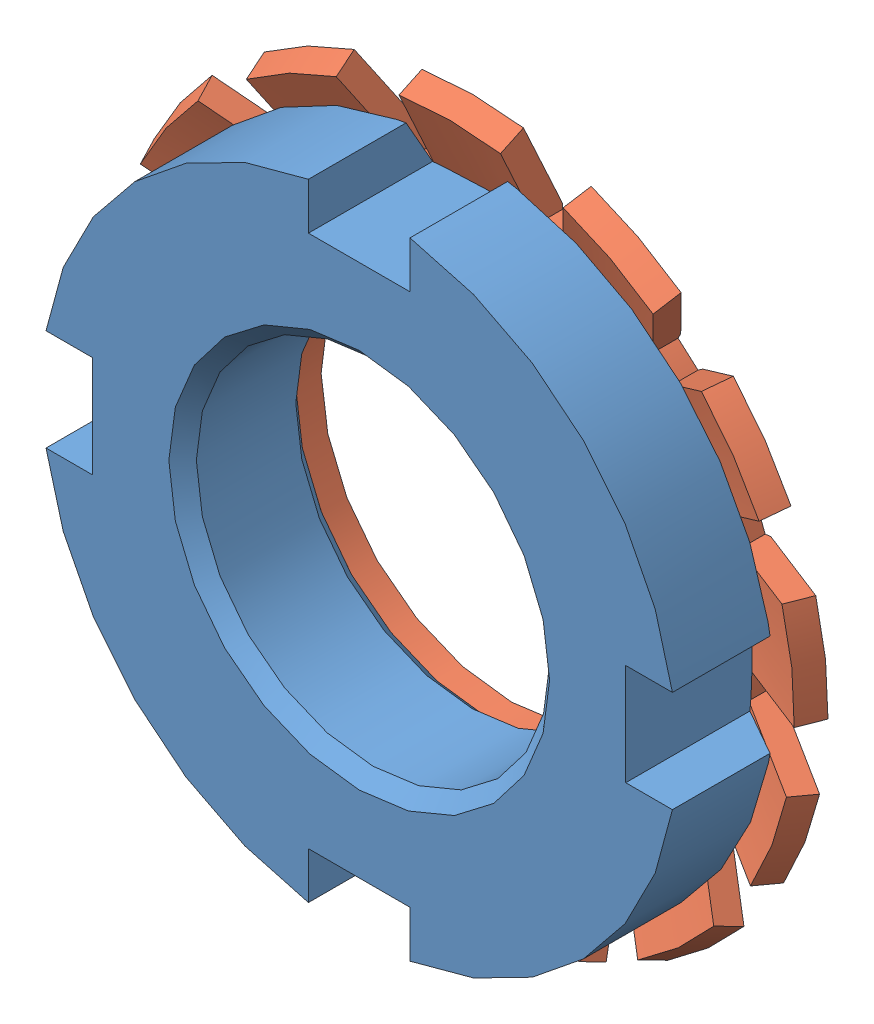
SolidWorks assembly JLNSK15.sldasm, configuration Default (file format 5000). Lengths in mm.
Overall size (28 27.93 7.5).
2 component instances, 2 part files, 0 mates.
Components (placement in the parent):
- JLNSK15nut-1: JLNSK15nut.sldprt [Default] at origin size (24.68 24.68 5)
- Washer15w-1: Washer15w.sldprt [Default] at (0 0 -6) size (28 27.93 3.94)
